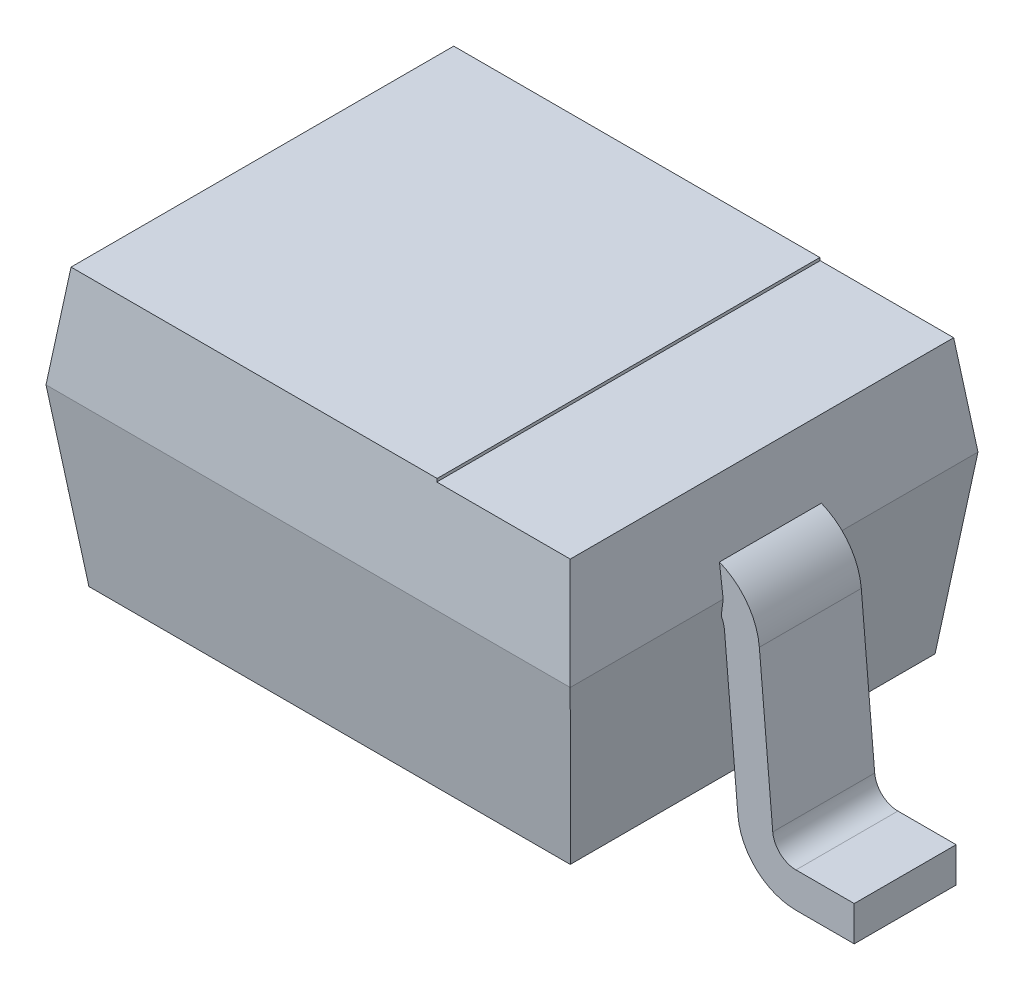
from build123d import *

# Parameters (mm, degrees)
EXTRUDE_START             = 0.8
SKETCH_1_W                = 1.8
SKETCH_1_H                = 1.4
EXTRUDE_1_DEPTH           = 0.35
EXTRUDE_1_TAPER           = 7
EXTRUDE_1_OTHER_WAY_DEPTH = 0.6
EXTRUDE_1_OTHER_WAY_TAPER = 7
EXTRUDE_2_DEPTH           = 0.175
SKETCH_3_W                = 0.5
SKETCH_3_H                = 1.4
CUT_EXTRUDE_3_DEPTH       = 0.01


with BuildPart() as part:
    # Sketch 1 → Extrude 1 (new body)
    with BuildSketch(Plane(origin=(0, 0, 0), x_dir=(1, 0, 0), z_dir=(0, 1, 0)).offset(EXTRUDE_START)):
        Rectangle(SKETCH_1_W, SKETCH_1_H)
    extrude(amount=EXTRUDE_1_DEPTH, taper=EXTRUDE_1_TAPER)

    # Sketch 1 → Extrude 1 other way (add)
    with BuildSketch(Plane(origin=(0, 0, 0), x_dir=(1, 0, 0), z_dir=(0, 1, 0)).offset(EXTRUDE_START)):
        Rectangle(SKETCH_1_W, SKETCH_1_H)
    extrude(amount=-EXTRUDE_1_OTHER_WAY_DEPTH, taper=EXTRUDE_1_OTHER_WAY_TAPER)

    # Sketch 2 → Extrude 2 (add, symmetric)
    with BuildSketch(Plane.XY):
        with BuildLine():
            Line((-1.35, 0), (-1.15, 0))
            ThreePointArc((-1.15, 0), (-1.014881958, 0.052544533), (-0.95076106, 0.182568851))
            Line((-0.95076106, 0.182568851), (-0.904729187, 0.708715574))
            ThreePointArc((-0.904729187, 0.708715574), (-0.872668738, 0.773727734), (-0.805109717, 0.8))
            Line((-0.805109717, 0.8), (0, 0.8))
            Line((0, 0.8), (0.805109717, 0.8))
            ThreePointArc((0.805109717, 0.8), (0.872668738, 0.773727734), (0.904729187, 0.708715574))
            Line((0.904729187, 0.708715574), (0.95076106, 0.182568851))
            ThreePointArc((0.95076106, 0.182568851), (1.014881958, 0.052544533), (1.15, 0))
            Line((1.15, 0), (1.35, 0))
            Line((1.35, 0), (1.35, 0.12))
            Line((1.35, 0.12), (1.15, 0.12))
            ThreePointArc((1.15, 0.12), (1.095952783, 0.141017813), (1.070304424, 0.193027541))
            Line((1.070304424, 0.193027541), (1.024272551, 0.719174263))
            ThreePointArc((1.024272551, 0.719174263), (0.953739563, 0.862201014), (0.805109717, 0.92))
            Line((0.805109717, 0.92), (0, 0.92))
            Line((0, 0.92), (-0.805109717, 0.92))
            ThreePointArc((-0.805109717, 0.92), (-0.953739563, 0.862201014), (-1.024272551, 0.719174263))
            Line((-1.024272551, 0.719174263), (-1.070304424, 0.193027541))
            ThreePointArc((-1.070304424, 0.193027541), (-1.095952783, 0.141017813), (-1.15, 0.12))
            Line((-1.15, 0.12), (-1.35, 0.12))
            Line((-1.35, 0.12), (-1.35, 0))
        make_face()
    extrude(amount=EXTRUDE_2_DEPTH, both=True)

    # Sketch 3 → Cut-Extrude 3 (cut)
    with BuildSketch(Plane(origin=(0, 1.15, 0), x_dir=(1, 0, 0), z_dir=(0, 1, 0))):
        with Locations((0.65, 0)):
            Rectangle(SKETCH_3_W, SKETCH_3_H)
    extrude(amount=-CUT_EXTRUDE_3_DEPTH, mode=Mode.SUBTRACT)


solid = part.part
